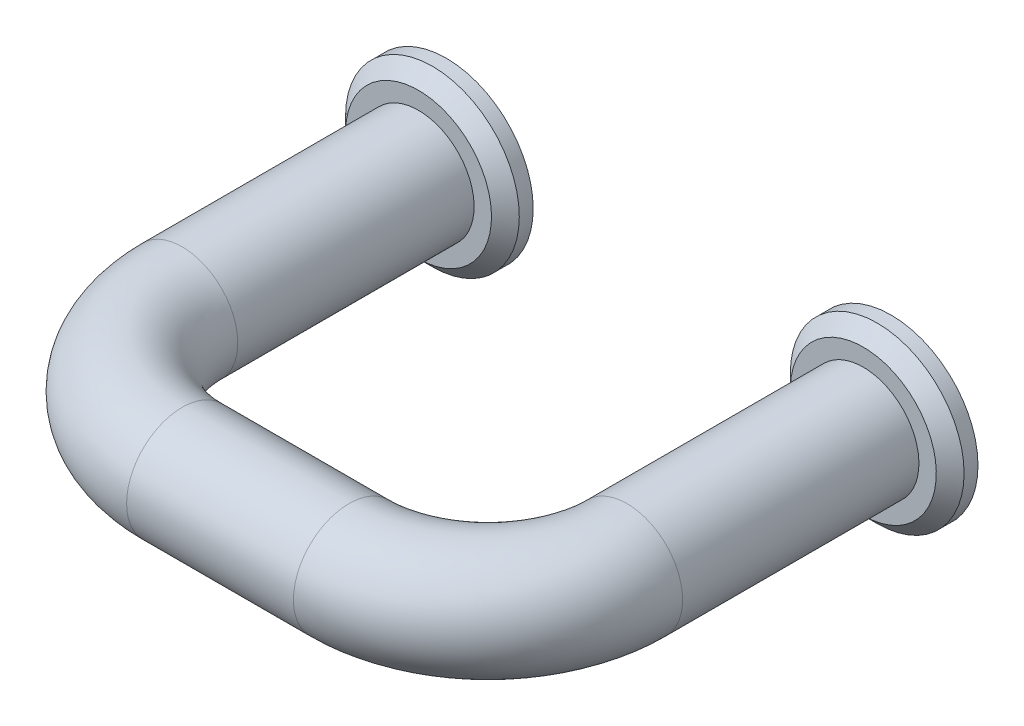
ISO-10303-21;
HEADER;
FILE_DESCRIPTION(('STEP AP214'),'2;1');
FILE_NAME('part.step','',(''),(''),'','','');
FILE_SCHEMA(('AUTOMOTIVE_DESIGN { 1 0 10303 214 1 1 1 1 }'));
ENDSEC;
DATA;
#1=APPLICATION_CONTEXT('core data for automotive mechanical design processes');
#2=APPLICATION_PROTOCOL_DEFINITION('international standard','automotive_design',2000,#1);
#3=PRODUCT_CONTEXT('',#1,'mechanical');
#4=PRODUCT('Part','Part','',(#3));
#5=PRODUCT_RELATED_PRODUCT_CATEGORY('part','',(#4));
#6=PRODUCT_DEFINITION_FORMATION('','',#4);
#7=PRODUCT_DEFINITION_CONTEXT('part definition',#1,'design');
#8=PRODUCT_DEFINITION('design','',#6,#7);
#9=PRODUCT_DEFINITION_SHAPE('','',#8);
#10=(LENGTH_UNIT() NAMED_UNIT(*) SI_UNIT(.MILLI.,.METRE.));
#11=(NAMED_UNIT(*) PLANE_ANGLE_UNIT() SI_UNIT($,.RADIAN.));
#12=(NAMED_UNIT(*) SI_UNIT($,.STERADIAN.) SOLID_ANGLE_UNIT());
#13=UNCERTAINTY_MEASURE_WITH_UNIT(LENGTH_MEASURE(1.E-05),#10,'distance_accuracy_value','');
#14=(GEOMETRIC_REPRESENTATION_CONTEXT(3) GLOBAL_UNCERTAINTY_ASSIGNED_CONTEXT((#13)) GLOBAL_UNIT_ASSIGNED_CONTEXT((#10,
#11,#12)) REPRESENTATION_CONTEXT('',''));
#15=CARTESIAN_POINT('',(0.,0.,0.));
#16=DIRECTION('',(0.,0.,1.));
#17=DIRECTION('',(1.,0.,0.));
#18=AXIS2_PLACEMENT_3D('',#15,#16,#17);
#19=CARTESIAN_POINT('',(0.,0.,0.));
#20=DIRECTION('',(0.,0.,-1.));
#21=DIRECTION('',(0.,1.,0.));
#22=AXIS2_PLACEMENT_3D('',#19,#20,#21);
#23=PLANE('',#22);
#24=CARTESIAN_POINT('',(0.,0.,0.));
#25=DIRECTION('',(0.,0.,1.));
#26=DIRECTION('',(0.,-1.,0.));
#27=AXIS2_PLACEMENT_3D('',#24,#25,#26);
#28=CIRCLE('',#27,6.25);
#29=CARTESIAN_POINT('',(0.,-6.25,0.));
#30=VERTEX_POINT('',#29);
#31=EDGE_CURVE('E56',#30,#30,#28,.T.);
#32=ORIENTED_EDGE('',*,*,#31,.F.);
#33=EDGE_LOOP('',(#32));
#34=FACE_BOUND('',#33,.T.);
#35=CARTESIAN_POINT('',(0.,0.,0.));
#36=DIRECTION('',(0.,0.,1.));
#37=DIRECTION('',(0.,-1.,0.));
#38=AXIS2_PLACEMENT_3D('',#35,#36,#37);
#39=CIRCLE('',#38,2.);
#40=CARTESIAN_POINT('',(0.,-2.,0.));
#41=VERTEX_POINT('',#40);
#42=EDGE_CURVE('E62',#41,#41,#39,.T.);
#43=ORIENTED_EDGE('',*,*,#42,.T.);
#44=EDGE_LOOP('',(#43));
#45=FACE_BOUND('',#44,.T.);
#46=ADVANCED_FACE('F12',(#34,#45),#23,.T.);
#47=CARTESIAN_POINT('',(0.,0.,19.));
#48=DIRECTION('',(0.,0.,-1.));
#49=DIRECTION('',(0.,-1.,0.));
#50=AXIS2_PLACEMENT_3D('',#47,#48,#49);
#51=CYLINDRICAL_SURFACE('',#50,4.);
#52=CARTESIAN_POINT('',(0.,0.,19.));
#53=DIRECTION('',(0.,0.,-1.));
#54=DIRECTION('',(0.,1.,0.));
#55=AXIS2_PLACEMENT_3D('',#52,#53,#54);
#56=CIRCLE('',#55,4.);
#57=CARTESIAN_POINT('',(-4.,0.,19.));
#58=VERTEX_POINT('',#57);
#59=EDGE_CURVE('E20',#58,#58,#56,.T.);
#60=ORIENTED_EDGE('',*,*,#59,.T.);
#61=EDGE_LOOP('',(#60));
#62=FACE_BOUND('',#61,.T.);
#63=CARTESIAN_POINT('',(0.,0.,2.));
#64=DIRECTION('',(0.,0.,-1.));
#65=DIRECTION('',(0.,-1.,0.));
#66=AXIS2_PLACEMENT_3D('',#63,#64,#65);
#67=CIRCLE('',#66,4.);
#68=CARTESIAN_POINT('',(0.,-4.,2.));
#69=VERTEX_POINT('',#68);
#70=EDGE_CURVE('E16',#69,#69,#67,.F.);
#71=ORIENTED_EDGE('',*,*,#70,.T.);
#72=EDGE_LOOP('',(#71));
#73=FACE_BOUND('',#72,.T.);
#74=ADVANCED_FACE('F14',(#62,#73),#51,.T.);
#75=CARTESIAN_POINT('',(32.,0.,19.));
#76=DIRECTION('',(0.,0.,-1.));
#77=DIRECTION('',(0.,-1.,0.));
#78=AXIS2_PLACEMENT_3D('',#75,#76,#77);
#79=CYLINDRICAL_SURFACE('',#78,4.);
#80=CARTESIAN_POINT('',(32.,0.,19.));
#81=DIRECTION('',(0.,0.,1.));
#82=DIRECTION('',(0.,1.,0.));
#83=AXIS2_PLACEMENT_3D('',#80,#81,#82);
#84=CIRCLE('',#83,4.);
#85=CARTESIAN_POINT('',(36.,0.,19.));
#86=VERTEX_POINT('',#85);
#87=EDGE_CURVE('E32',#86,#86,#84,.T.);
#88=ORIENTED_EDGE('',*,*,#87,.F.);
#89=EDGE_LOOP('',(#88));
#90=FACE_BOUND('',#89,.T.);
#91=CARTESIAN_POINT('',(32.,0.,2.));
#92=DIRECTION('',(0.,0.,-1.));
#93=DIRECTION('',(0.,-1.,0.));
#94=AXIS2_PLACEMENT_3D('',#91,#92,#93);
#95=CIRCLE('',#94,4.);
#96=CARTESIAN_POINT('',(32.,-4.,2.));
#97=VERTEX_POINT('',#96);
#98=EDGE_CURVE('E8',#97,#97,#95,.T.);
#99=ORIENTED_EDGE('',*,*,#98,.F.);
#100=EDGE_LOOP('',(#99));
#101=FACE_BOUND('',#100,.T.);
#102=ADVANCED_FACE('F89',(#90,#101),#79,.T.);
#103=CARTESIAN_POINT('',(10.,0.,19.));
#104=DIRECTION('',(0.,-1.,0.));
#105=DIRECTION('',(1.,0.,0.));
#106=AXIS2_PLACEMENT_3D('',#103,#104,#105);
#107=TOROIDAL_SURFACE('',#106,10.,4.);
#108=CARTESIAN_POINT('',(10.,0.,29.));
#109=DIRECTION('',(-1.,0.,0.));
#110=DIRECTION('',(0.,1.,0.));
#111=AXIS2_PLACEMENT_3D('',#108,#109,#110);
#112=CIRCLE('',#111,4.);
#113=CARTESIAN_POINT('',(10.,0.,33.));
#114=VERTEX_POINT('',#113);
#115=EDGE_CURVE('E24',#114,#114,#112,.T.);
#116=CARTESIAN_POINT('',(10.,0.,19.));
#117=DIRECTION('',(0.,-1.,0.));
#118=DIRECTION('',(1.,0.,0.));
#119=AXIS2_PLACEMENT_3D('',#116,#117,#118);
#120=CIRCLE('',#119,14.);
#121=EDGE_CURVE('',#114,#58,#120,.T.);
#122=ORIENTED_EDGE('',*,*,#115,.T.);
#123=ORIENTED_EDGE('',*,*,#59,.F.);
#124=ORIENTED_EDGE('',*,*,#121,.T.);
#125=ORIENTED_EDGE('',*,*,#121,.F.);
#126=EDGE_LOOP('',(#122,#124,#123,#125));
#127=FACE_BOUND('',#126,.T.);
#128=ADVANCED_FACE('F98',(#127),#107,.T.);
#129=CARTESIAN_POINT('',(22.,0.,29.));
#130=DIRECTION('',(-1.,0.,0.));
#131=DIRECTION('',(0.,0.,1.));
#132=AXIS2_PLACEMENT_3D('',#129,#130,#131);
#133=CYLINDRICAL_SURFACE('',#132,4.);
#134=CARTESIAN_POINT('',(22.,0.,29.));
#135=DIRECTION('',(-1.,0.,0.));
#136=DIRECTION('',(0.,1.,0.));
#137=AXIS2_PLACEMENT_3D('',#134,#135,#136);
#138=CIRCLE('',#137,4.);
#139=CARTESIAN_POINT('',(22.,0.,33.));
#140=VERTEX_POINT('',#139);
#141=EDGE_CURVE('E29',#140,#140,#138,.T.);
#142=ORIENTED_EDGE('',*,*,#141,.T.);
#143=EDGE_LOOP('',(#142));
#144=FACE_BOUND('',#143,.T.);
#145=ORIENTED_EDGE('',*,*,#115,.F.);
#146=EDGE_LOOP('',(#145));
#147=FACE_BOUND('',#146,.T.);
#148=ADVANCED_FACE('F104',(#144,#147),#133,.T.);
#149=CARTESIAN_POINT('',(22.,0.,19.));
#150=DIRECTION('',(0.,-1.,0.));
#151=DIRECTION('',(1.,0.,0.));
#152=AXIS2_PLACEMENT_3D('',#149,#150,#151);
#153=TOROIDAL_SURFACE('',#152,10.,4.);
#154=CARTESIAN_POINT('',(22.,0.,19.));
#155=DIRECTION('',(0.,-1.,0.));
#156=DIRECTION('',(1.,0.,0.));
#157=AXIS2_PLACEMENT_3D('',#154,#155,#156);
#158=CIRCLE('',#157,14.);
#159=EDGE_CURVE('',#86,#140,#158,.T.);
#160=ORIENTED_EDGE('',*,*,#87,.T.);
#161=ORIENTED_EDGE('',*,*,#141,.F.);
#162=ORIENTED_EDGE('',*,*,#159,.T.);
#163=ORIENTED_EDGE('',*,*,#159,.F.);
#164=EDGE_LOOP('',(#160,#162,#161,#163));
#165=FACE_BOUND('',#164,.T.);
#166=ADVANCED_FACE('F100',(#165),#153,.T.);
#167=CARTESIAN_POINT('',(32.,0.,2.));
#168=DIRECTION('',(0.,0.,-1.));
#169=DIRECTION('',(0.,-1.,0.));
#170=AXIS2_PLACEMENT_3D('',#167,#168,#169);
#171=PLANE('',#170);
#172=CARTESIAN_POINT('',(32.,0.,2.));
#173=DIRECTION('',(0.,0.,-1.));
#174=DIRECTION('',(0.,-1.,0.));
#175=AXIS2_PLACEMENT_3D('',#172,#173,#174);
#176=CIRCLE('',#175,5.25);
#177=CARTESIAN_POINT('',(32.,-5.25,2.));
#178=VERTEX_POINT('',#177);
#179=EDGE_CURVE('E35',#178,#178,#176,.T.);
#180=ORIENTED_EDGE('',*,*,#179,.F.);
#181=EDGE_LOOP('',(#180));
#182=FACE_BOUND('',#181,.T.);
#183=ORIENTED_EDGE('',*,*,#98,.T.);
#184=EDGE_LOOP('',(#183));
#185=FACE_BOUND('',#184,.T.);
#186=ADVANCED_FACE('F103',(#182,#185),#171,.F.);
#187=CARTESIAN_POINT('',(32.,0.,2.));
#188=DIRECTION('',(0.,0.,-1.));
#189=DIRECTION('',(0.,-1.,0.));
#190=AXIS2_PLACEMENT_3D('',#187,#188,#189);
#191=CONICAL_SURFACE('',#190,5.25,0.785398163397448);
#192=CARTESIAN_POINT('',(32.,0.,1.));
#193=DIRECTION('',(0.,0.,-1.));
#194=DIRECTION('',(0.,-1.,0.));
#195=AXIS2_PLACEMENT_3D('',#192,#193,#194);
#196=CIRCLE('',#195,6.25);
#197=CARTESIAN_POINT('',(32.,-6.25,1.));
#198=VERTEX_POINT('',#197);
#199=EDGE_CURVE('E38',#198,#198,#196,.T.);
#200=ORIENTED_EDGE('',*,*,#199,.F.);
#201=EDGE_LOOP('',(#200));
#202=FACE_BOUND('',#201,.T.);
#203=ORIENTED_EDGE('',*,*,#179,.T.);
#204=EDGE_LOOP('',(#203));
#205=FACE_BOUND('',#204,.T.);
#206=ADVANCED_FACE('F142',(#202,#205),#191,.T.);
#207=CARTESIAN_POINT('',(32.,0.,0.));
#208=DIRECTION('',(0.,0.,-1.));
#209=DIRECTION('',(0.,-1.,0.));
#210=AXIS2_PLACEMENT_3D('',#207,#208,#209);
#211=CYLINDRICAL_SURFACE('',#210,6.25);
#212=CARTESIAN_POINT('',(32.,0.,0.));
#213=DIRECTION('',(0.,0.,-1.));
#214=DIRECTION('',(0.,-1.,0.));
#215=AXIS2_PLACEMENT_3D('',#212,#213,#214);
#216=CIRCLE('',#215,6.25);
#217=CARTESIAN_POINT('',(32.,-6.25,0.));
#218=VERTEX_POINT('',#217);
#219=EDGE_CURVE('E41',#218,#218,#216,.T.);
#220=ORIENTED_EDGE('',*,*,#219,.F.);
#221=EDGE_LOOP('',(#220));
#222=FACE_BOUND('',#221,.T.);
#223=ORIENTED_EDGE('',*,*,#199,.T.);
#224=EDGE_LOOP('',(#223));
#225=FACE_BOUND('',#224,.T.);
#226=ADVANCED_FACE('F139',(#222,#225),#211,.T.);
#227=CARTESIAN_POINT('',(32.,0.,0.));
#228=DIRECTION('',(0.,0.,1.));
#229=DIRECTION('',(0.,1.,0.));
#230=AXIS2_PLACEMENT_3D('',#227,#228,#229);
#231=PLANE('',#230);
#232=CARTESIAN_POINT('',(32.,0.,0.));
#233=DIRECTION('',(0.,0.,-1.));
#234=DIRECTION('',(0.,-1.,0.));
#235=AXIS2_PLACEMENT_3D('',#232,#233,#234);
#236=CIRCLE('',#235,2.);
#237=CARTESIAN_POINT('',(32.,-2.,0.));
#238=VERTEX_POINT('',#237);
#239=EDGE_CURVE('E47',#238,#238,#236,.T.);
#240=ORIENTED_EDGE('',*,*,#239,.F.);
#241=EDGE_LOOP('',(#240));
#242=FACE_BOUND('',#241,.T.);
#243=ORIENTED_EDGE('',*,*,#219,.T.);
#244=EDGE_LOOP('',(#243));
#245=FACE_BOUND('',#244,.T.);
#246=ADVANCED_FACE('F94',(#242,#245),#231,.F.);
#247=CARTESIAN_POINT('',(32.,0.,9.));
#248=DIRECTION('',(0.,0.,-1.));
#249=DIRECTION('',(0.,-1.,0.));
#250=AXIS2_PLACEMENT_3D('',#247,#248,#249);
#251=CYLINDRICAL_SURFACE('',#250,2.);
#252=CARTESIAN_POINT('',(32.,0.,9.));
#253=DIRECTION('',(0.,0.,-1.));
#254=DIRECTION('',(0.,-1.,0.));
#255=AXIS2_PLACEMENT_3D('',#252,#253,#254);
#256=CIRCLE('',#255,2.);
#257=CARTESIAN_POINT('',(32.,-2.,9.));
#258=VERTEX_POINT('',#257);
#259=EDGE_CURVE('E44',#258,#258,#256,.T.);
#260=ORIENTED_EDGE('',*,*,#259,.F.);
#261=EDGE_LOOP('',(#260));
#262=FACE_BOUND('',#261,.T.);
#263=ORIENTED_EDGE('',*,*,#239,.T.);
#264=EDGE_LOOP('',(#263));
#265=FACE_BOUND('',#264,.T.);
#266=ADVANCED_FACE('F124',(#262,#265),#251,.F.);
#267=CARTESIAN_POINT('',(32.,0.,9.));
#268=DIRECTION('',(0.,0.,-1.));
#269=DIRECTION('',(0.,-1.,0.));
#270=AXIS2_PLACEMENT_3D('',#267,#268,#269);
#271=PLANE('',#270);
#272=ORIENTED_EDGE('',*,*,#259,.T.);
#273=EDGE_LOOP('',(#272));
#274=FACE_BOUND('',#273,.T.);
#275=ADVANCED_FACE('F122',(#274),#271,.T.);
#276=CARTESIAN_POINT('',(0.,0.,2.));
#277=DIRECTION('',(0.,0.,-1.));
#278=DIRECTION('',(0.,-1.,0.));
#279=AXIS2_PLACEMENT_3D('',#276,#277,#278);
#280=PLANE('',#279);
#281=ORIENTED_EDGE('',*,*,#70,.F.);
#282=EDGE_LOOP('',(#281));
#283=FACE_BOUND('',#282,.T.);
#284=CARTESIAN_POINT('',(0.,0.,2.));
#285=DIRECTION('',(0.,0.,1.));
#286=DIRECTION('',(0.,-1.,0.));
#287=AXIS2_PLACEMENT_3D('',#284,#285,#286);
#288=CIRCLE('',#287,5.25);
#289=CARTESIAN_POINT('',(0.,-5.25,2.));
#290=VERTEX_POINT('',#289);
#291=EDGE_CURVE('E50',#290,#290,#288,.T.);
#292=ORIENTED_EDGE('',*,*,#291,.T.);
#293=EDGE_LOOP('',(#292));
#294=FACE_BOUND('',#293,.T.);
#295=ADVANCED_FACE('F119',(#283,#294),#280,.F.);
#296=CARTESIAN_POINT('',(0.,0.,2.));
#297=DIRECTION('',(0.,0.,-1.));
#298=DIRECTION('',(0.,-1.,0.));
#299=AXIS2_PLACEMENT_3D('',#296,#297,#298);
#300=CONICAL_SURFACE('',#299,5.25,0.785398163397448);
#301=CARTESIAN_POINT('',(0.,0.,1.));
#302=DIRECTION('',(0.,0.,1.));
#303=DIRECTION('',(0.,-1.,0.));
#304=AXIS2_PLACEMENT_3D('',#301,#302,#303);
#305=CIRCLE('',#304,6.25);
#306=CARTESIAN_POINT('',(0.,-6.25,1.));
#307=VERTEX_POINT('',#306);
#308=EDGE_CURVE('E53',#307,#307,#305,.T.);
#309=ORIENTED_EDGE('',*,*,#308,.T.);
#310=EDGE_LOOP('',(#309));
#311=FACE_BOUND('',#310,.T.);
#312=ORIENTED_EDGE('',*,*,#291,.F.);
#313=EDGE_LOOP('',(#312));
#314=FACE_BOUND('',#313,.T.);
#315=ADVANCED_FACE('F80',(#311,#314),#300,.T.);
#316=CARTESIAN_POINT('',(0.,0.,0.));
#317=DIRECTION('',(0.,0.,-1.));
#318=DIRECTION('',(0.,-1.,0.));
#319=AXIS2_PLACEMENT_3D('',#316,#317,#318);
#320=CYLINDRICAL_SURFACE('',#319,6.25);
#321=ORIENTED_EDGE('',*,*,#31,.T.);
#322=EDGE_LOOP('',(#321));
#323=FACE_BOUND('',#322,.T.);
#324=ORIENTED_EDGE('',*,*,#308,.F.);
#325=EDGE_LOOP('',(#324));
#326=FACE_BOUND('',#325,.T.);
#327=ADVANCED_FACE('F70',(#323,#326),#320,.T.);
#328=CARTESIAN_POINT('',(0.,0.,9.));
#329=DIRECTION('',(0.,0.,-1.));
#330=DIRECTION('',(0.,-1.,0.));
#331=AXIS2_PLACEMENT_3D('',#328,#329,#330);
#332=CYLINDRICAL_SURFACE('',#331,2.);
#333=CARTESIAN_POINT('',(0.,0.,9.));
#334=DIRECTION('',(0.,0.,1.));
#335=DIRECTION('',(0.,-1.,0.));
#336=AXIS2_PLACEMENT_3D('',#333,#334,#335);
#337=CIRCLE('',#336,2.);
#338=CARTESIAN_POINT('',(0.,-2.,9.));
#339=VERTEX_POINT('',#338);
#340=EDGE_CURVE('E59',#339,#339,#337,.T.);
#341=ORIENTED_EDGE('',*,*,#340,.T.);
#342=EDGE_LOOP('',(#341));
#343=FACE_BOUND('',#342,.T.);
#344=ORIENTED_EDGE('',*,*,#42,.F.);
#345=EDGE_LOOP('',(#344));
#346=FACE_BOUND('',#345,.T.);
#347=ADVANCED_FACE('F67',(#343,#346),#332,.F.);
#348=CARTESIAN_POINT('',(0.,0.,9.));
#349=DIRECTION('',(0.,0.,-1.));
#350=DIRECTION('',(0.,-1.,0.));
#351=AXIS2_PLACEMENT_3D('',#348,#349,#350);
#352=PLANE('',#351);
#353=ORIENTED_EDGE('',*,*,#340,.F.);
#354=EDGE_LOOP('',(#353));
#355=FACE_BOUND('',#354,.T.);
#356=ADVANCED_FACE('F69',(#355),#352,.T.);
#357=CLOSED_SHELL('',(#46,#74,#102,#128,#148,#166,#186,#206,#226,#246,#266,#275,#295,#315,#327,
#347,#356));
#358=MANIFOLD_SOLID_BREP('B1',#357);
#359=ADVANCED_BREP_SHAPE_REPRESENTATION('',(#18,#358),#14);
#360=SHAPE_DEFINITION_REPRESENTATION(#9,#359);
ENDSEC;
END-ISO-10303-21;
